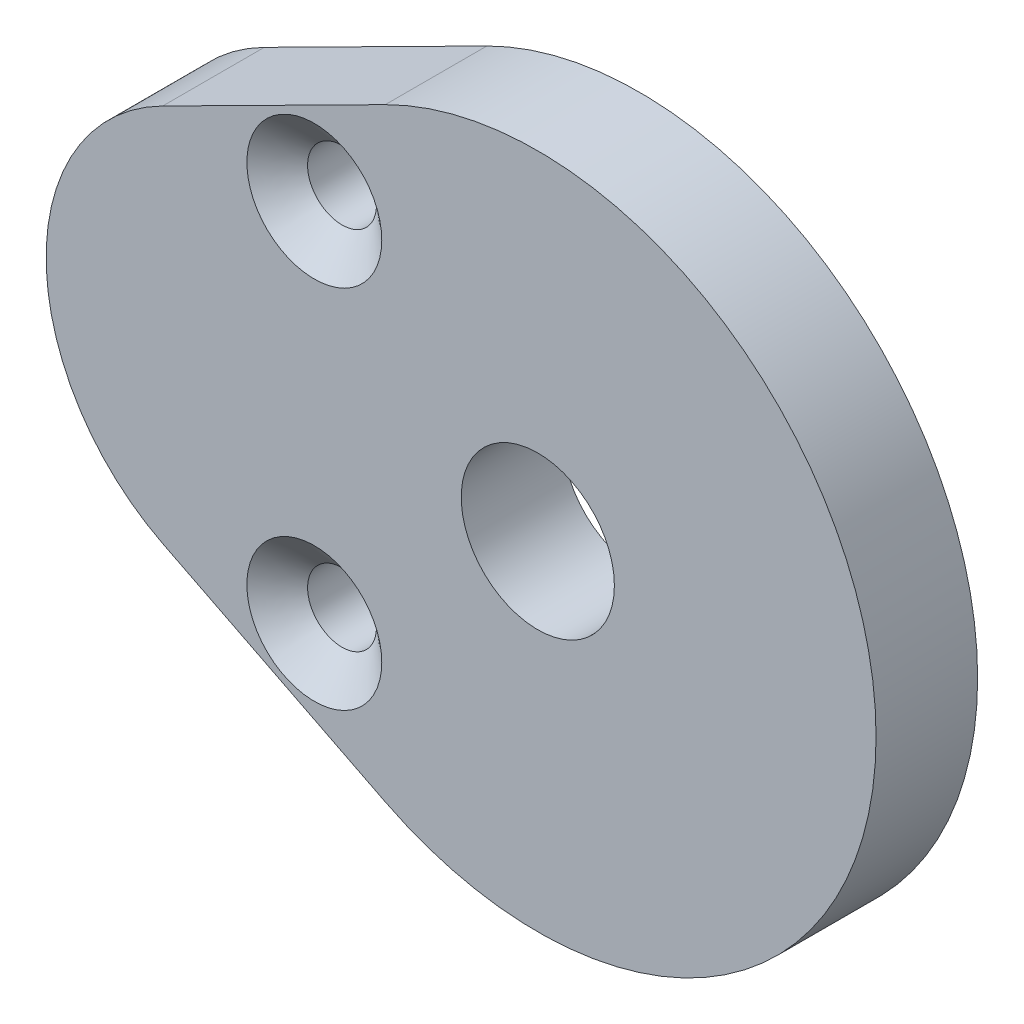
ISO-10303-21;
HEADER;
FILE_DESCRIPTION(('STEP AP214'),'2;1');
FILE_NAME('part.step','',(''),(''),'','','');
FILE_SCHEMA(('AUTOMOTIVE_DESIGN { 1 0 10303 214 1 1 1 1 }'));
ENDSEC;
DATA;
#1=APPLICATION_CONTEXT('core data for automotive mechanical design processes');
#2=APPLICATION_PROTOCOL_DEFINITION('international standard','automotive_design',2000,#1);
#3=PRODUCT_CONTEXT('',#1,'mechanical');
#4=PRODUCT('Part','Part','',(#3));
#5=PRODUCT_RELATED_PRODUCT_CATEGORY('part','',(#4));
#6=PRODUCT_DEFINITION_FORMATION('','',#4);
#7=PRODUCT_DEFINITION_CONTEXT('part definition',#1,'design');
#8=PRODUCT_DEFINITION('design','',#6,#7);
#9=PRODUCT_DEFINITION_SHAPE('','',#8);
#10=(LENGTH_UNIT() NAMED_UNIT(*) SI_UNIT(.MILLI.,.METRE.));
#11=(NAMED_UNIT(*) PLANE_ANGLE_UNIT() SI_UNIT($,.RADIAN.));
#12=(NAMED_UNIT(*) SI_UNIT($,.STERADIAN.) SOLID_ANGLE_UNIT());
#13=UNCERTAINTY_MEASURE_WITH_UNIT(LENGTH_MEASURE(1.E-05),#10,'distance_accuracy_value','');
#14=(GEOMETRIC_REPRESENTATION_CONTEXT(3) GLOBAL_UNCERTAINTY_ASSIGNED_CONTEXT((#13)) GLOBAL_UNIT_ASSIGNED_CONTEXT((#10,
#11,#12)) REPRESENTATION_CONTEXT('',''));
#15=CARTESIAN_POINT('',(0.,0.,0.));
#16=DIRECTION('',(0.,0.,1.));
#17=DIRECTION('',(1.,0.,0.));
#18=AXIS2_PLACEMENT_3D('',#15,#16,#17);
#19=CARTESIAN_POINT('',(-17.4625,0.,6.35));
#20=DIRECTION('',(0.,0.,-1.));
#21=DIRECTION('',(-1.,0.,0.));
#22=AXIS2_PLACEMENT_3D('',#19,#20,#21);
#23=CYLINDRICAL_SURFACE('',#22,13.2715);
#24=CARTESIAN_POINT('',(-17.4625,0.,0.));
#25=DIRECTION('',(0.,0.,1.));
#26=DIRECTION('',(1.,0.,0.));
#27=AXIS2_PLACEMENT_3D('',#24,#25,#26);
#28=CIRCLE('',#27,13.2715);
#29=CARTESIAN_POINT('',(-23.44674,11.8457411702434,0.));
#30=VERTEX_POINT('',#29);
#31=CARTESIAN_POINT('',(-23.44674,-11.8457411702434,0.));
#32=VERTEX_POINT('',#31);
#33=EDGE_CURVE('E108',#30,#32,#28,.T.);
#34=ORIENTED_EDGE('',*,*,#33,.T.);
#35=DIRECTION('',(0.,0.,-1.));
#36=VECTOR('',#35,1.);
#37=CARTESIAN_POINT('',(-23.44674,-11.8457411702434,6.35));
#38=LINE('',#37,#36);
#39=CARTESIAN_POINT('',(-23.44674,-11.8457411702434,6.35));
#40=VERTEX_POINT('',#39);
#41=EDGE_CURVE('E11',#40,#32,#38,.T.);
#42=ORIENTED_EDGE('',*,*,#41,.F.);
#43=CARTESIAN_POINT('',(-17.4625,0.,6.35));
#44=DIRECTION('',(0.,0.,1.));
#45=DIRECTION('',(1.,0.,0.));
#46=AXIS2_PLACEMENT_3D('',#43,#44,#45);
#47=CIRCLE('',#46,13.2715);
#48=CARTESIAN_POINT('',(-23.44674,11.8457411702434,6.35));
#49=VERTEX_POINT('',#48);
#50=EDGE_CURVE('E96',#49,#40,#47,.T.);
#51=ORIENTED_EDGE('',*,*,#50,.F.);
#52=DIRECTION('',(0.,0.,-1.));
#53=VECTOR('',#52,1.);
#54=CARTESIAN_POINT('',(-23.44674,11.8457411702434,6.35));
#55=LINE('',#54,#53);
#56=EDGE_CURVE('E104',#49,#30,#55,.T.);
#57=ORIENTED_EDGE('',*,*,#56,.T.);
#58=EDGE_LOOP('',(#34,#42,#51,#57));
#59=FACE_BOUND('',#58,.T.);
#60=ADVANCED_FACE('F45',(#59),#23,.T.);
#61=CARTESIAN_POINT('',(-23.44674,-11.8457411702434,6.35));
#62=DIRECTION('',(0.450909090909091,0.89256988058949,0.));
#63=DIRECTION('',(-0.89256988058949,0.450909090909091,0.));
#64=AXIS2_PLACEMENT_3D('',#61,#62,#63);
#65=PLANE('',#64);
#66=DIRECTION('',(0.89256988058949,-0.450909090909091,0.));
#67=VECTOR('',#66,1.);
#68=CARTESIAN_POINT('',(-23.44674,-11.8457411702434,0.));
#69=LINE('',#68,#67);
#70=CARTESIAN_POINT('',(-9.53469818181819,-18.8738364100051,0.));
#71=VERTEX_POINT('',#70);
#72=EDGE_CURVE('E100',#32,#71,#69,.T.);
#73=ORIENTED_EDGE('',*,*,#72,.T.);
#74=DIRECTION('',(0.,0.,-1.));
#75=VECTOR('',#74,1.);
#76=CARTESIAN_POINT('',(-9.53469818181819,-18.8738364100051,6.35));
#77=LINE('',#76,#75);
#78=CARTESIAN_POINT('',(-9.53469818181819,-18.8738364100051,6.35));
#79=VERTEX_POINT('',#78);
#80=EDGE_CURVE('E53',#79,#71,#77,.T.);
#81=ORIENTED_EDGE('',*,*,#80,.F.);
#82=DIRECTION('',(0.89256988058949,-0.450909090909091,0.));
#83=VECTOR('',#82,1.);
#84=CARTESIAN_POINT('',(-23.44674,-11.8457411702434,6.35));
#85=LINE('',#84,#83);
#86=EDGE_CURVE('E91',#40,#79,#85,.T.);
#87=ORIENTED_EDGE('',*,*,#86,.F.);
#88=ORIENTED_EDGE('',*,*,#41,.T.);
#89=EDGE_LOOP('',(#73,#81,#87,#88));
#90=FACE_BOUND('',#89,.T.);
#91=ADVANCED_FACE('F99',(#90),#65,.F.);
#92=CARTESIAN_POINT('',(0.,0.,6.35));
#93=DIRECTION('',(0.,0.,-1.));
#94=DIRECTION('',(-1.,0.,0.));
#95=AXIS2_PLACEMENT_3D('',#92,#93,#94);
#96=CYLINDRICAL_SURFACE('',#95,21.1455);
#97=CARTESIAN_POINT('',(0.,0.,0.));
#98=DIRECTION('',(0.,0.,1.));
#99=DIRECTION('',(1.,0.,0.));
#100=AXIS2_PLACEMENT_3D('',#97,#98,#99);
#101=CIRCLE('',#100,21.1455);
#102=CARTESIAN_POINT('',(-9.53469818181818,18.8738364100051,0.));
#103=VERTEX_POINT('',#102);
#104=EDGE_CURVE('E78',#71,#103,#101,.T.);
#105=ORIENTED_EDGE('',*,*,#104,.T.);
#106=DIRECTION('',(0.,0.,-1.));
#107=VECTOR('',#106,1.);
#108=CARTESIAN_POINT('',(-9.53469818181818,18.8738364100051,6.35));
#109=LINE('',#108,#107);
#110=CARTESIAN_POINT('',(-9.53469818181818,18.8738364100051,6.35));
#111=VERTEX_POINT('',#110);
#112=EDGE_CURVE('E101',#111,#103,#109,.T.);
#113=ORIENTED_EDGE('',*,*,#112,.F.);
#114=CARTESIAN_POINT('',(0.,0.,6.35));
#115=DIRECTION('',(0.,0.,1.));
#116=DIRECTION('',(1.,0.,0.));
#117=AXIS2_PLACEMENT_3D('',#114,#115,#116);
#118=CIRCLE('',#117,21.1455);
#119=EDGE_CURVE('E94',#79,#111,#118,.T.);
#120=ORIENTED_EDGE('',*,*,#119,.F.);
#121=ORIENTED_EDGE('',*,*,#80,.T.);
#122=EDGE_LOOP('',(#105,#113,#120,#121));
#123=FACE_BOUND('',#122,.T.);
#124=ADVANCED_FACE('F102',(#123),#96,.T.);
#125=CARTESIAN_POINT('',(-23.44674,11.8457411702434,6.35));
#126=DIRECTION('',(0.45090909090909,-0.89256988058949,0.));
#127=DIRECTION('',(0.892569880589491,0.45090909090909,0.));
#128=AXIS2_PLACEMENT_3D('',#125,#126,#127);
#129=PLANE('',#128);
#130=DIRECTION('',(-0.892569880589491,-0.45090909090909,0.));
#131=VECTOR('',#130,1.);
#132=CARTESIAN_POINT('',(-23.44674,11.8457411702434,0.));
#133=LINE('',#132,#131);
#134=EDGE_CURVE('E84',#103,#30,#133,.T.);
#135=ORIENTED_EDGE('',*,*,#134,.T.);
#136=ORIENTED_EDGE('',*,*,#56,.F.);
#137=DIRECTION('',(-0.892569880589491,-0.45090909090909,0.));
#138=VECTOR('',#137,1.);
#139=CARTESIAN_POINT('',(-23.44674,11.8457411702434,6.35));
#140=LINE('',#139,#138);
#141=EDGE_CURVE('E61',#111,#49,#140,.T.);
#142=ORIENTED_EDGE('',*,*,#141,.F.);
#143=ORIENTED_EDGE('',*,*,#112,.T.);
#144=EDGE_LOOP('',(#135,#136,#142,#143));
#145=FACE_BOUND('',#144,.T.);
#146=ADVANCED_FACE('F116',(#145),#129,.F.);
#147=CARTESIAN_POINT('',(-17.4625,0.,6.35));
#148=DIRECTION('',(0.,0.,1.));
#149=DIRECTION('',(1.,0.,0.));
#150=AXIS2_PLACEMENT_3D('',#147,#148,#149);
#151=PLANE('',#150);
#152=CARTESIAN_POINT('',(-13.97,11.43,6.35));
#153=DIRECTION('',(0.,0.,1.));
#154=DIRECTION('',(1.,0.,0.));
#155=AXIS2_PLACEMENT_3D('',#152,#153,#154);
#156=CIRCLE('',#155,4.2164);
#157=CARTESIAN_POINT('',(-9.7536,11.43,6.35));
#158=VERTEX_POINT('',#157);
#159=EDGE_CURVE('E142',#158,#158,#156,.T.);
#160=ORIENTED_EDGE('',*,*,#159,.F.);
#161=EDGE_LOOP('',(#160));
#162=FACE_BOUND('',#161,.T.);
#163=CARTESIAN_POINT('',(-13.97,-11.43,6.35));
#164=DIRECTION('',(0.,0.,1.));
#165=DIRECTION('',(1.,0.,0.));
#166=AXIS2_PLACEMENT_3D('',#163,#164,#165);
#167=CIRCLE('',#166,4.2164);
#168=CARTESIAN_POINT('',(-9.7536,-11.43,6.35));
#169=VERTEX_POINT('',#168);
#170=EDGE_CURVE('E133',#169,#169,#167,.T.);
#171=ORIENTED_EDGE('',*,*,#170,.F.);
#172=EDGE_LOOP('',(#171));
#173=FACE_BOUND('',#172,.T.);
#174=CARTESIAN_POINT('',(0.,0.,6.35));
#175=DIRECTION('',(0.,0.,1.));
#176=DIRECTION('',(1.,0.,0.));
#177=AXIS2_PLACEMENT_3D('',#174,#175,#176);
#178=CIRCLE('',#177,4.7879);
#179=CARTESIAN_POINT('',(4.7879,0.,6.35));
#180=VERTEX_POINT('',#179);
#181=EDGE_CURVE('E122',#180,#180,#178,.T.);
#182=ORIENTED_EDGE('',*,*,#181,.F.);
#183=EDGE_LOOP('',(#182));
#184=FACE_BOUND('',#183,.T.);
#185=ORIENTED_EDGE('',*,*,#50,.T.);
#186=ORIENTED_EDGE('',*,*,#86,.T.);
#187=ORIENTED_EDGE('',*,*,#119,.T.);
#188=ORIENTED_EDGE('',*,*,#141,.T.);
#189=EDGE_LOOP('',(#185,#186,#187,#188));
#190=FACE_BOUND('',#189,.T.);
#191=ADVANCED_FACE('F92',(#162,#173,#184,#190),#151,.T.);
#192=CARTESIAN_POINT('',(-17.4625,0.,0.));
#193=DIRECTION('',(0.,0.,1.));
#194=DIRECTION('',(1.,0.,0.));
#195=AXIS2_PLACEMENT_3D('',#192,#193,#194);
#196=PLANE('',#195);
#197=CARTESIAN_POINT('',(-13.97,11.43,0.));
#198=DIRECTION('',(0.,0.,1.));
#199=DIRECTION('',(1.,0.,0.));
#200=AXIS2_PLACEMENT_3D('',#197,#198,#199);
#201=CIRCLE('',#200,2.15264999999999);
#202=CARTESIAN_POINT('',(-11.81735,11.43,0.));
#203=VERTEX_POINT('',#202);
#204=EDGE_CURVE('E136',#203,#203,#201,.T.);
#205=ORIENTED_EDGE('',*,*,#204,.T.);
#206=EDGE_LOOP('',(#205));
#207=FACE_BOUND('',#206,.T.);
#208=CARTESIAN_POINT('',(-13.97,-11.43,0.));
#209=DIRECTION('',(0.,0.,1.));
#210=DIRECTION('',(1.,0.,0.));
#211=AXIS2_PLACEMENT_3D('',#208,#209,#210);
#212=CIRCLE('',#211,2.15264999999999);
#213=CARTESIAN_POINT('',(-11.81735,-11.43,0.));
#214=VERTEX_POINT('',#213);
#215=EDGE_CURVE('E125',#214,#214,#212,.T.);
#216=ORIENTED_EDGE('',*,*,#215,.T.);
#217=EDGE_LOOP('',(#216));
#218=FACE_BOUND('',#217,.T.);
#219=CARTESIAN_POINT('',(0.,0.,0.));
#220=DIRECTION('',(0.,0.,1.));
#221=DIRECTION('',(1.,0.,0.));
#222=AXIS2_PLACEMENT_3D('',#219,#220,#221);
#223=CIRCLE('',#222,4.7879);
#224=CARTESIAN_POINT('',(4.7879,0.,0.));
#225=VERTEX_POINT('',#224);
#226=EDGE_CURVE('E111',#225,#225,#223,.T.);
#227=ORIENTED_EDGE('',*,*,#226,.T.);
#228=EDGE_LOOP('',(#227));
#229=FACE_BOUND('',#228,.T.);
#230=ORIENTED_EDGE('',*,*,#33,.F.);
#231=ORIENTED_EDGE('',*,*,#134,.F.);
#232=ORIENTED_EDGE('',*,*,#104,.F.);
#233=ORIENTED_EDGE('',*,*,#72,.F.);
#234=EDGE_LOOP('',(#230,#231,#232,#233));
#235=FACE_BOUND('',#234,.T.);
#236=ADVANCED_FACE('F119',(#207,#218,#229,#235),#196,.F.);
#237=CARTESIAN_POINT('',(0.,0.,0.));
#238=DIRECTION('',(0.,0.,1.));
#239=DIRECTION('',(1.,0.,0.));
#240=AXIS2_PLACEMENT_3D('',#237,#238,#239);
#241=CYLINDRICAL_SURFACE('',#240,4.7879);
#242=ORIENTED_EDGE('',*,*,#226,.F.);
#243=EDGE_LOOP('',(#242));
#244=FACE_BOUND('',#243,.T.);
#245=ORIENTED_EDGE('',*,*,#181,.T.);
#246=EDGE_LOOP('',(#245));
#247=FACE_BOUND('',#246,.T.);
#248=ADVANCED_FACE('F155',(#244,#247),#241,.F.);
#249=CARTESIAN_POINT('',(-13.97,-11.43,6.35));
#250=DIRECTION('',(0.,0.,1.));
#251=DIRECTION('',(1.,0.,0.));
#252=AXIS2_PLACEMENT_3D('',#249,#250,#251);
#253=CYLINDRICAL_SURFACE('',#252,2.15264999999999);
#254=ORIENTED_EDGE('',*,*,#215,.F.);
#255=EDGE_LOOP('',(#254));
#256=FACE_BOUND('',#255,.T.);
#257=CARTESIAN_POINT('',(-13.97,-11.43,4.61830813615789));
#258=DIRECTION('',(0.,0.,1.));
#259=DIRECTION('',(1.,0.,0.));
#260=AXIS2_PLACEMENT_3D('',#257,#258,#259);
#261=CIRCLE('',#260,2.15265);
#262=CARTESIAN_POINT('',(-11.81735,-11.43,4.61830813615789));
#263=VERTEX_POINT('',#262);
#264=EDGE_CURVE('E130',#263,#263,#261,.T.);
#265=ORIENTED_EDGE('',*,*,#264,.T.);
#266=EDGE_LOOP('',(#265));
#267=FACE_BOUND('',#266,.T.);
#268=ADVANCED_FACE('F157',(#256,#267),#253,.F.);
#269=CARTESIAN_POINT('',(-13.97,-11.43,6.35));
#270=DIRECTION('',(0.,0.,1.));
#271=DIRECTION('',(1.,0.,0.));
#272=AXIS2_PLACEMENT_3D('',#269,#270,#271);
#273=CONICAL_SURFACE('',#272,4.2164,0.872664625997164);
#274=ORIENTED_EDGE('',*,*,#264,.F.);
#275=EDGE_LOOP('',(#274));
#276=FACE_BOUND('',#275,.T.);
#277=ORIENTED_EDGE('',*,*,#170,.T.);
#278=EDGE_LOOP('',(#277));
#279=FACE_BOUND('',#278,.T.);
#280=ADVANCED_FACE('F164',(#276,#279),#273,.F.);
#281=CARTESIAN_POINT('',(-13.97,11.43,6.35));
#282=DIRECTION('',(0.,0.,1.));
#283=DIRECTION('',(1.,0.,0.));
#284=AXIS2_PLACEMENT_3D('',#281,#282,#283);
#285=CYLINDRICAL_SURFACE('',#284,2.15264999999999);
#286=ORIENTED_EDGE('',*,*,#204,.F.);
#287=EDGE_LOOP('',(#286));
#288=FACE_BOUND('',#287,.T.);
#289=CARTESIAN_POINT('',(-13.97,11.43,4.61830813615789));
#290=DIRECTION('',(0.,0.,1.));
#291=DIRECTION('',(1.,0.,0.));
#292=AXIS2_PLACEMENT_3D('',#289,#290,#291);
#293=CIRCLE('',#292,2.15265);
#294=CARTESIAN_POINT('',(-11.81735,11.43,4.61830813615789));
#295=VERTEX_POINT('',#294);
#296=EDGE_CURVE('E139',#295,#295,#293,.T.);
#297=ORIENTED_EDGE('',*,*,#296,.T.);
#298=EDGE_LOOP('',(#297));
#299=FACE_BOUND('',#298,.T.);
#300=ADVANCED_FACE('F224',(#288,#299),#285,.F.);
#301=CARTESIAN_POINT('',(-13.97,11.43,6.35));
#302=DIRECTION('',(0.,0.,1.));
#303=DIRECTION('',(1.,0.,0.));
#304=AXIS2_PLACEMENT_3D('',#301,#302,#303);
#305=CONICAL_SURFACE('',#304,4.2164,0.872664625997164);
#306=ORIENTED_EDGE('',*,*,#296,.F.);
#307=EDGE_LOOP('',(#306));
#308=FACE_BOUND('',#307,.T.);
#309=ORIENTED_EDGE('',*,*,#159,.T.);
#310=EDGE_LOOP('',(#309));
#311=FACE_BOUND('',#310,.T.);
#312=ADVANCED_FACE('F146',(#308,#311),#305,.F.);
#313=CLOSED_SHELL('',(#60,#91,#124,#146,#191,#236,#248,#268,#280,#300,#312));
#314=MANIFOLD_SOLID_BREP('B2',#313);
#315=ADVANCED_BREP_SHAPE_REPRESENTATION('',(#18,#314),#14);
#316=SHAPE_DEFINITION_REPRESENTATION(#9,#315);
ENDSEC;
END-ISO-10303-21;
